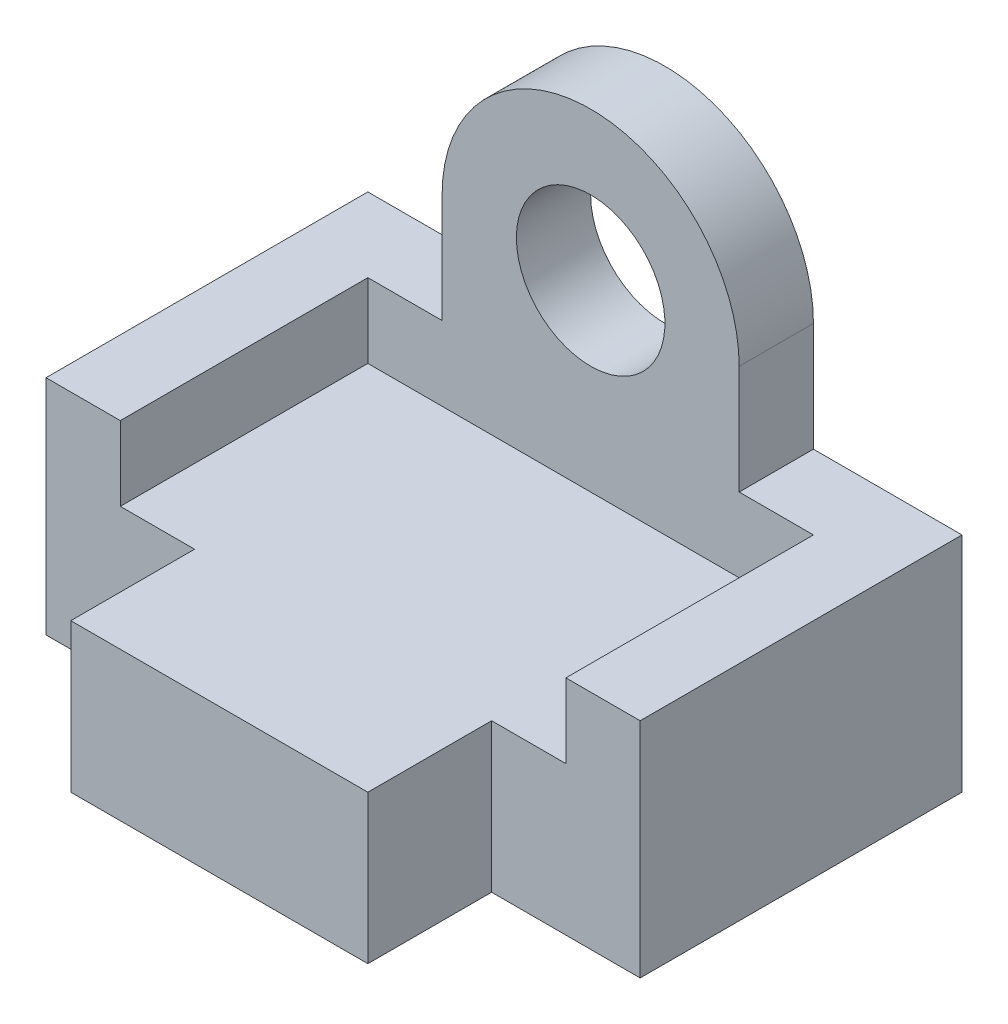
ISO-10303-21;
HEADER;
FILE_DESCRIPTION(('STEP AP214'),'2;1');
FILE_NAME('part.step','',(''),(''),'','','');
FILE_SCHEMA(('AUTOMOTIVE_DESIGN { 1 0 10303 214 1 1 1 1 }'));
ENDSEC;
DATA;
#1=APPLICATION_CONTEXT('core data for automotive mechanical design processes');
#2=APPLICATION_PROTOCOL_DEFINITION('international standard','automotive_design',2000,#1);
#3=PRODUCT_CONTEXT('',#1,'mechanical');
#4=PRODUCT('Part','Part','',(#3));
#5=PRODUCT_RELATED_PRODUCT_CATEGORY('part','',(#4));
#6=PRODUCT_DEFINITION_FORMATION('','',#4);
#7=PRODUCT_DEFINITION_CONTEXT('part definition',#1,'design');
#8=PRODUCT_DEFINITION('design','',#6,#7);
#9=PRODUCT_DEFINITION_SHAPE('','',#8);
#10=(LENGTH_UNIT() NAMED_UNIT(*) SI_UNIT(.MILLI.,.METRE.));
#11=(NAMED_UNIT(*) PLANE_ANGLE_UNIT() SI_UNIT($,.RADIAN.));
#12=(NAMED_UNIT(*) SI_UNIT($,.STERADIAN.) SOLID_ANGLE_UNIT());
#13=UNCERTAINTY_MEASURE_WITH_UNIT(LENGTH_MEASURE(1.E-05),#10,'distance_accuracy_value','');
#14=(GEOMETRIC_REPRESENTATION_CONTEXT(3) GLOBAL_UNCERTAINTY_ASSIGNED_CONTEXT((#13)) GLOBAL_UNIT_ASSIGNED_CONTEXT((#10,
#11,#12)) REPRESENTATION_CONTEXT('',''));
#15=CARTESIAN_POINT('',(0.,0.,0.));
#16=DIRECTION('',(0.,0.,1.));
#17=DIRECTION('',(1.,0.,0.));
#18=AXIS2_PLACEMENT_3D('',#15,#16,#17);
#19=CARTESIAN_POINT('',(-106.292846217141,45.,32.5));
#20=DIRECTION('',(0.,1.,0.));
#21=DIRECTION('',(0.,0.,1.));
#22=AXIS2_PLACEMENT_3D('',#19,#20,#21);
#23=PLANE('',#22);
#24=DIRECTION('',(1.,0.,0.));
#25=VECTOR('',#24,1.);
#26=CARTESIAN_POINT('',(-106.292846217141,45.,15.));
#27=LINE('',#26,#25);
#28=CARTESIAN_POINT('',(-45.,45.,15.));
#29=VERTEX_POINT('',#28);
#30=CARTESIAN_POINT('',(-30.,45.,15.));
#31=VERTEX_POINT('',#30);
#32=EDGE_CURVE('E162',#29,#31,#27,.T.);
#33=ORIENTED_EDGE('',*,*,#32,.T.);
#34=DIRECTION('',(0.,0.,-1.));
#35=VECTOR('',#34,1.);
#36=CARTESIAN_POINT('',(-30.,45.,15.));
#37=LINE('',#36,#35);
#38=CARTESIAN_POINT('',(-30.,45.,0.));
#39=VERTEX_POINT('',#38);
#40=EDGE_CURVE('E144',#31,#39,#37,.T.);
#41=ORIENTED_EDGE('',*,*,#40,.T.);
#42=DIRECTION('',(1.,0.,0.));
#43=VECTOR('',#42,1.);
#44=CARTESIAN_POINT('',(-106.292846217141,45.,0.));
#45=LINE('',#44,#43);
#46=CARTESIAN_POINT('',(-60.,45.,0.));
#47=VERTEX_POINT('',#46);
#48=EDGE_CURVE('E201',#47,#39,#45,.T.);
#49=ORIENTED_EDGE('',*,*,#48,.F.);
#50=DIRECTION('',(0.,0.,1.));
#51=VECTOR('',#50,1.);
#52=CARTESIAN_POINT('',(-60.,45.,32.5));
#53=LINE('',#52,#51);
#54=CARTESIAN_POINT('',(-60.,45.,65.));
#55=VERTEX_POINT('',#54);
#56=EDGE_CURVE('E196',#47,#55,#53,.T.);
#57=ORIENTED_EDGE('',*,*,#56,.T.);
#58=DIRECTION('',(1.,0.,0.));
#59=VECTOR('',#58,1.);
#60=CARTESIAN_POINT('',(-106.292846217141,45.,65.));
#61=LINE('',#60,#59);
#62=CARTESIAN_POINT('',(-45.,45.,65.));
#63=VERTEX_POINT('',#62);
#64=EDGE_CURVE('E203',#55,#63,#61,.T.);
#65=ORIENTED_EDGE('',*,*,#64,.T.);
#66=DIRECTION('',(0.,0.,1.));
#67=VECTOR('',#66,1.);
#68=CARTESIAN_POINT('',(-45.,45.,32.5));
#69=LINE('',#68,#67);
#70=EDGE_CURVE('E170',#29,#63,#69,.T.);
#71=ORIENTED_EDGE('',*,*,#70,.F.);
#72=EDGE_LOOP('',(#33,#41,#49,#57,#65,#71));
#73=FACE_BOUND('',#72,.T.);
#74=ADVANCED_FACE('F31',(#73),#23,.T.);
#75=CARTESIAN_POINT('',(-106.292846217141,30.,65.));
#76=DIRECTION('',(0.,0.,-1.));
#77=DIRECTION('',(-1.,0.,0.));
#78=AXIS2_PLACEMENT_3D('',#75,#76,#77);
#79=PLANE('',#78);
#80=DIRECTION('',(0.,-1.,0.));
#81=VECTOR('',#80,1.);
#82=CARTESIAN_POINT('',(-30.,30.,65.));
#83=LINE('',#82,#81);
#84=CARTESIAN_POINT('',(-30.,30.,65.));
#85=VERTEX_POINT('',#84);
#86=CARTESIAN_POINT('',(-30.,0.,65.));
#87=VERTEX_POINT('',#86);
#88=EDGE_CURVE('E56',#85,#87,#83,.T.);
#89=ORIENTED_EDGE('',*,*,#88,.F.);
#90=DIRECTION('',(1.,0.,0.));
#91=VECTOR('',#90,1.);
#92=CARTESIAN_POINT('',(-106.292846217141,30.,65.));
#93=LINE('',#92,#91);
#94=CARTESIAN_POINT('',(-45.,30.,65.));
#95=VERTEX_POINT('',#94);
#96=EDGE_CURVE('E253',#95,#85,#93,.T.);
#97=ORIENTED_EDGE('',*,*,#96,.F.);
#98=DIRECTION('',(0.,-1.,0.));
#99=VECTOR('',#98,1.);
#100=CARTESIAN_POINT('',(-45.,45.,65.));
#101=LINE('',#100,#99);
#102=EDGE_CURVE('E394',#63,#95,#101,.T.);
#103=ORIENTED_EDGE('',*,*,#102,.F.);
#104=ORIENTED_EDGE('',*,*,#64,.F.);
#105=DIRECTION('',(0.,-1.,0.));
#106=VECTOR('',#105,1.);
#107=CARTESIAN_POINT('',(-60.,45.,65.));
#108=LINE('',#107,#106);
#109=CARTESIAN_POINT('',(-60.,0.,65.));
#110=VERTEX_POINT('',#109);
#111=EDGE_CURVE('E396',#55,#110,#108,.T.);
#112=ORIENTED_EDGE('',*,*,#111,.T.);
#113=DIRECTION('',(1.,0.,0.));
#114=VECTOR('',#113,1.);
#115=CARTESIAN_POINT('',(-106.292846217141,0.,65.));
#116=LINE('',#115,#114);
#117=EDGE_CURVE('E257',#110,#87,#116,.T.);
#118=ORIENTED_EDGE('',*,*,#117,.T.);
#119=EDGE_LOOP('',(#89,#97,#103,#104,#112,#118));
#120=FACE_BOUND('',#119,.T.);
#121=ADVANCED_FACE('F33',(#120),#79,.F.);
#122=DIRECTION('',(0.,1.,0.));
#123=VECTOR('',#122,1.);
#124=CARTESIAN_POINT('',(30.,30.,65.));
#125=LINE('',#124,#123);
#126=CARTESIAN_POINT('',(30.,0.,65.));
#127=VERTEX_POINT('',#126);
#128=CARTESIAN_POINT('',(30.,30.,65.));
#129=VERTEX_POINT('',#128);
#130=EDGE_CURVE('E266',#127,#129,#125,.T.);
#131=ORIENTED_EDGE('',*,*,#130,.F.);
#132=CARTESIAN_POINT('',(60.,0.,65.));
#133=VERTEX_POINT('',#132);
#134=EDGE_CURVE('E235',#127,#133,#116,.T.);
#135=ORIENTED_EDGE('',*,*,#134,.T.);
#136=DIRECTION('',(0.,-1.,0.));
#137=VECTOR('',#136,1.);
#138=CARTESIAN_POINT('',(60.,45.,65.));
#139=LINE('',#138,#137);
#140=CARTESIAN_POINT('',(60.,45.,65.));
#141=VERTEX_POINT('',#140);
#142=EDGE_CURVE('E223',#141,#133,#139,.T.);
#143=ORIENTED_EDGE('',*,*,#142,.F.);
#144=DIRECTION('',(1.,0.,0.));
#145=VECTOR('',#144,1.);
#146=CARTESIAN_POINT('',(-106.292846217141,45.,65.));
#147=LINE('',#146,#145);
#148=CARTESIAN_POINT('',(45.,45.,65.));
#149=VERTEX_POINT('',#148);
#150=EDGE_CURVE('E174',#149,#141,#147,.T.);
#151=ORIENTED_EDGE('',*,*,#150,.F.);
#152=DIRECTION('',(0.,-1.,0.));
#153=VECTOR('',#152,1.);
#154=CARTESIAN_POINT('',(45.,45.,65.));
#155=LINE('',#154,#153);
#156=CARTESIAN_POINT('',(45.,30.,65.));
#157=VERTEX_POINT('',#156);
#158=EDGE_CURVE('E236',#149,#157,#155,.T.);
#159=ORIENTED_EDGE('',*,*,#158,.T.);
#160=EDGE_CURVE('E250',#129,#157,#93,.T.);
#161=ORIENTED_EDGE('',*,*,#160,.F.);
#162=EDGE_LOOP('',(#131,#135,#143,#151,#159,#161));
#163=FACE_BOUND('',#162,.T.);
#164=ADVANCED_FACE('F233',(#163),#79,.F.);
#165=CARTESIAN_POINT('',(-106.292846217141,30.,32.5));
#166=DIRECTION('',(0.,1.,0.));
#167=DIRECTION('',(0.,0.,1.));
#168=AXIS2_PLACEMENT_3D('',#165,#166,#167);
#169=PLANE('',#168);
#170=ORIENTED_EDGE('',*,*,#96,.T.);
#171=DIRECTION('',(0.,0.,-1.));
#172=VECTOR('',#171,1.);
#173=CARTESIAN_POINT('',(-30.,30.,90.));
#174=LINE('',#173,#172);
#175=CARTESIAN_POINT('',(-30.,30.,90.));
#176=VERTEX_POINT('',#175);
#177=EDGE_CURVE('E281',#176,#85,#174,.T.);
#178=ORIENTED_EDGE('',*,*,#177,.F.);
#179=DIRECTION('',(-1.,0.,0.));
#180=VECTOR('',#179,1.);
#181=CARTESIAN_POINT('',(-30.,30.,90.));
#182=LINE('',#181,#180);
#183=CARTESIAN_POINT('',(30.,30.,90.));
#184=VERTEX_POINT('',#183);
#185=EDGE_CURVE('E280',#184,#176,#182,.T.);
#186=ORIENTED_EDGE('',*,*,#185,.F.);
#187=DIRECTION('',(0.,0.,-1.));
#188=VECTOR('',#187,1.);
#189=CARTESIAN_POINT('',(30.,30.,90.));
#190=LINE('',#189,#188);
#191=EDGE_CURVE('E273',#184,#129,#190,.T.);
#192=ORIENTED_EDGE('',*,*,#191,.T.);
#193=ORIENTED_EDGE('',*,*,#160,.T.);
#194=DIRECTION('',(0.,0.,1.));
#195=VECTOR('',#194,1.);
#196=CARTESIAN_POINT('',(45.,30.,32.5));
#197=LINE('',#196,#195);
#198=CARTESIAN_POINT('',(45.,30.,15.));
#199=VERTEX_POINT('',#198);
#200=EDGE_CURVE('E246',#199,#157,#197,.T.);
#201=ORIENTED_EDGE('',*,*,#200,.F.);
#202=DIRECTION('',(1.,0.,0.));
#203=VECTOR('',#202,1.);
#204=CARTESIAN_POINT('',(-106.292846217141,30.,15.));
#205=LINE('',#204,#203);
#206=CARTESIAN_POINT('',(-45.,30.,15.));
#207=VERTEX_POINT('',#206);
#208=EDGE_CURVE('E40',#207,#199,#205,.T.);
#209=ORIENTED_EDGE('',*,*,#208,.F.);
#210=DIRECTION('',(0.,0.,1.));
#211=VECTOR('',#210,1.);
#212=CARTESIAN_POINT('',(-45.,30.,32.5));
#213=LINE('',#212,#211);
#214=EDGE_CURVE('E11',#207,#95,#213,.T.);
#215=ORIENTED_EDGE('',*,*,#214,.T.);
#216=EDGE_LOOP('',(#170,#178,#186,#192,#193,#201,#209,#215));
#217=FACE_BOUND('',#216,.T.);
#218=ADVANCED_FACE('F278',(#217),#169,.T.);
#219=CARTESIAN_POINT('',(-106.292846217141,0.,32.5));
#220=DIRECTION('',(0.,1.,0.));
#221=DIRECTION('',(0.,0.,1.));
#222=AXIS2_PLACEMENT_3D('',#219,#220,#221);
#223=PLANE('',#222);
#224=DIRECTION('',(0.,0.,1.));
#225=VECTOR('',#224,1.);
#226=CARTESIAN_POINT('',(60.,0.,32.5));
#227=LINE('',#226,#225);
#228=CARTESIAN_POINT('',(60.,0.,0.));
#229=VERTEX_POINT('',#228);
#230=EDGE_CURVE('E221',#229,#133,#227,.T.);
#231=ORIENTED_EDGE('',*,*,#230,.T.);
#232=ORIENTED_EDGE('',*,*,#134,.F.);
#233=DIRECTION('',(0.,0.,-1.));
#234=VECTOR('',#233,1.);
#235=CARTESIAN_POINT('',(30.,0.,90.));
#236=LINE('',#235,#234);
#237=CARTESIAN_POINT('',(30.,0.,90.));
#238=VERTEX_POINT('',#237);
#239=EDGE_CURVE('E276',#238,#127,#236,.T.);
#240=ORIENTED_EDGE('',*,*,#239,.F.);
#241=DIRECTION('',(1.,0.,0.));
#242=VECTOR('',#241,1.);
#243=CARTESIAN_POINT('',(-30.,0.,90.));
#244=LINE('',#243,#242);
#245=CARTESIAN_POINT('',(-30.,0.,90.));
#246=VERTEX_POINT('',#245);
#247=EDGE_CURVE('E301',#246,#238,#244,.T.);
#248=ORIENTED_EDGE('',*,*,#247,.F.);
#249=DIRECTION('',(0.,0.,-1.));
#250=VECTOR('',#249,1.);
#251=CARTESIAN_POINT('',(-30.,0.,90.));
#252=LINE('',#251,#250);
#253=EDGE_CURVE('E283',#246,#87,#252,.T.);
#254=ORIENTED_EDGE('',*,*,#253,.T.);
#255=ORIENTED_EDGE('',*,*,#117,.F.);
#256=DIRECTION('',(0.,0.,1.));
#257=VECTOR('',#256,1.);
#258=CARTESIAN_POINT('',(-60.,0.,32.5));
#259=LINE('',#258,#257);
#260=CARTESIAN_POINT('',(-60.,0.,0.));
#261=VERTEX_POINT('',#260);
#262=EDGE_CURVE('E176',#261,#110,#259,.T.);
#263=ORIENTED_EDGE('',*,*,#262,.F.);
#264=DIRECTION('',(1.,0.,0.));
#265=VECTOR('',#264,1.);
#266=CARTESIAN_POINT('',(-106.292846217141,0.,0.));
#267=LINE('',#266,#265);
#268=EDGE_CURVE('E385',#261,#229,#267,.T.);
#269=ORIENTED_EDGE('',*,*,#268,.T.);
#270=EDGE_LOOP('',(#231,#232,#240,#248,#254,#255,#263,#269));
#271=FACE_BOUND('',#270,.T.);
#272=ADVANCED_FACE('F378',(#271),#223,.F.);
#273=CARTESIAN_POINT('',(-106.292846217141,45.,15.));
#274=DIRECTION('',(0.,0.,-1.));
#275=DIRECTION('',(-1.,0.,0.));
#276=AXIS2_PLACEMENT_3D('',#273,#274,#275);
#277=PLANE('',#276);
#278=ORIENTED_EDGE('',*,*,#208,.T.);
#279=DIRECTION('',(0.,-1.,0.));
#280=VECTOR('',#279,1.);
#281=CARTESIAN_POINT('',(45.,45.,15.));
#282=LINE('',#281,#280);
#283=CARTESIAN_POINT('',(45.,45.,15.));
#284=VERTEX_POINT('',#283);
#285=EDGE_CURVE('E238',#284,#199,#282,.T.);
#286=ORIENTED_EDGE('',*,*,#285,.F.);
#287=CARTESIAN_POINT('',(30.,45.,15.));
#288=VERTEX_POINT('',#287);
#289=EDGE_CURVE('E172',#288,#284,#27,.T.);
#290=ORIENTED_EDGE('',*,*,#289,.F.);
#291=DIRECTION('',(0.,-1.,0.));
#292=VECTOR('',#291,1.);
#293=CARTESIAN_POINT('',(30.,45.,15.));
#294=LINE('',#293,#292);
#295=CARTESIAN_POINT('',(30.,67.,15.));
#296=VERTEX_POINT('',#295);
#297=EDGE_CURVE('E153',#296,#288,#294,.T.);
#298=ORIENTED_EDGE('',*,*,#297,.F.);
#299=CARTESIAN_POINT('',(0.,67.,15.));
#300=DIRECTION('',(0.,0.,-1.));
#301=DIRECTION('',(1.,0.,0.));
#302=AXIS2_PLACEMENT_3D('',#299,#300,#301);
#303=CIRCLE('',#302,30.);
#304=CARTESIAN_POINT('',(-30.,67.,15.));
#305=VERTEX_POINT('',#304);
#306=EDGE_CURVE('E166',#305,#296,#303,.T.);
#307=ORIENTED_EDGE('',*,*,#306,.F.);
#308=DIRECTION('',(0.,1.,0.));
#309=VECTOR('',#308,1.);
#310=CARTESIAN_POINT('',(-30.,67.,15.));
#311=LINE('',#310,#309);
#312=EDGE_CURVE('E147',#31,#305,#311,.T.);
#313=ORIENTED_EDGE('',*,*,#312,.F.);
#314=ORIENTED_EDGE('',*,*,#32,.F.);
#315=DIRECTION('',(0.,-1.,0.));
#316=VECTOR('',#315,1.);
#317=CARTESIAN_POINT('',(-45.,45.,15.));
#318=LINE('',#317,#316);
#319=EDGE_CURVE('E392',#29,#207,#318,.T.);
#320=ORIENTED_EDGE('',*,*,#319,.T.);
#321=EDGE_LOOP('',(#278,#286,#290,#298,#307,#313,#314,#320));
#322=FACE_BOUND('',#321,.T.);
#323=CARTESIAN_POINT('',(0.,67.,15.));
#324=DIRECTION('',(0.,0.,-1.));
#325=DIRECTION('',(-1.,0.,0.));
#326=AXIS2_PLACEMENT_3D('',#323,#324,#325);
#327=CIRCLE('',#326,15.);
#328=CARTESIAN_POINT('',(-15.,67.,15.));
#329=VERTEX_POINT('',#328);
#330=EDGE_CURVE('E324',#329,#329,#327,.T.);
#331=ORIENTED_EDGE('',*,*,#330,.T.);
#332=EDGE_LOOP('',(#331));
#333=FACE_BOUND('',#332,.T.);
#334=ADVANCED_FACE('F159',(#322,#333),#277,.F.);
#335=CARTESIAN_POINT('',(45.,45.,32.5));
#336=DIRECTION('',(1.,0.,0.));
#337=DIRECTION('',(0.,0.,-1.));
#338=AXIS2_PLACEMENT_3D('',#335,#336,#337);
#339=PLANE('',#338);
#340=ORIENTED_EDGE('',*,*,#200,.T.);
#341=ORIENTED_EDGE('',*,*,#158,.F.);
#342=DIRECTION('',(0.,0.,1.));
#343=VECTOR('',#342,1.);
#344=CARTESIAN_POINT('',(45.,45.,32.5));
#345=LINE('',#344,#343);
#346=EDGE_CURVE('E171',#284,#149,#345,.T.);
#347=ORIENTED_EDGE('',*,*,#346,.F.);
#348=ORIENTED_EDGE('',*,*,#285,.T.);
#349=EDGE_LOOP('',(#340,#341,#347,#348));
#350=FACE_BOUND('',#349,.T.);
#351=ADVANCED_FACE('F263',(#350),#339,.F.);
#352=CARTESIAN_POINT('',(60.,45.,32.5));
#353=DIRECTION('',(1.,0.,0.));
#354=DIRECTION('',(0.,0.,-1.));
#355=AXIS2_PLACEMENT_3D('',#352,#353,#354);
#356=PLANE('',#355);
#357=ORIENTED_EDGE('',*,*,#230,.F.);
#358=DIRECTION('',(0.,-1.,0.));
#359=VECTOR('',#358,1.);
#360=CARTESIAN_POINT('',(60.,45.,0.));
#361=LINE('',#360,#359);
#362=CARTESIAN_POINT('',(60.,45.,0.));
#363=VERTEX_POINT('',#362);
#364=EDGE_CURVE('E210',#363,#229,#361,.T.);
#365=ORIENTED_EDGE('',*,*,#364,.F.);
#366=DIRECTION('',(0.,0.,1.));
#367=VECTOR('',#366,1.);
#368=CARTESIAN_POINT('',(60.,45.,32.5));
#369=LINE('',#368,#367);
#370=EDGE_CURVE('E190',#363,#141,#369,.T.);
#371=ORIENTED_EDGE('',*,*,#370,.T.);
#372=ORIENTED_EDGE('',*,*,#142,.T.);
#373=EDGE_LOOP('',(#357,#365,#371,#372));
#374=FACE_BOUND('',#373,.T.);
#375=ADVANCED_FACE('F218',(#374),#356,.T.);
#376=CARTESIAN_POINT('',(-106.292846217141,45.,0.));
#377=DIRECTION('',(0.,0.,-1.));
#378=DIRECTION('',(-1.,0.,0.));
#379=AXIS2_PLACEMENT_3D('',#376,#377,#378);
#380=PLANE('',#379);
#381=ORIENTED_EDGE('',*,*,#268,.F.);
#382=DIRECTION('',(0.,-1.,0.));
#383=VECTOR('',#382,1.);
#384=CARTESIAN_POINT('',(-60.,45.,0.));
#385=LINE('',#384,#383);
#386=EDGE_CURVE('E224',#47,#261,#385,.T.);
#387=ORIENTED_EDGE('',*,*,#386,.F.);
#388=ORIENTED_EDGE('',*,*,#48,.T.);
#389=DIRECTION('',(0.,1.,0.));
#390=VECTOR('',#389,1.);
#391=CARTESIAN_POINT('',(-30.,67.,0.));
#392=LINE('',#391,#390);
#393=CARTESIAN_POINT('',(-30.,67.,0.));
#394=VERTEX_POINT('',#393);
#395=EDGE_CURVE('E48',#39,#394,#392,.T.);
#396=ORIENTED_EDGE('',*,*,#395,.T.);
#397=CARTESIAN_POINT('',(0.,67.,0.));
#398=DIRECTION('',(0.,0.,-1.));
#399=DIRECTION('',(1.,0.,0.));
#400=AXIS2_PLACEMENT_3D('',#397,#398,#399);
#401=CIRCLE('',#400,30.);
#402=CARTESIAN_POINT('',(30.,67.,0.));
#403=VERTEX_POINT('',#402);
#404=EDGE_CURVE('E319',#394,#403,#401,.T.);
#405=ORIENTED_EDGE('',*,*,#404,.T.);
#406=DIRECTION('',(0.,-1.,0.));
#407=VECTOR('',#406,1.);
#408=CARTESIAN_POINT('',(30.,45.,0.));
#409=LINE('',#408,#407);
#410=CARTESIAN_POINT('',(30.,45.,0.));
#411=VERTEX_POINT('',#410);
#412=EDGE_CURVE('E167',#403,#411,#409,.T.);
#413=ORIENTED_EDGE('',*,*,#412,.T.);
#414=EDGE_CURVE('E193',#411,#363,#45,.T.);
#415=ORIENTED_EDGE('',*,*,#414,.T.);
#416=ORIENTED_EDGE('',*,*,#364,.T.);
#417=EDGE_LOOP('',(#381,#387,#388,#396,#405,#413,#415,#416));
#418=FACE_BOUND('',#417,.T.);
#419=CARTESIAN_POINT('',(0.,67.,0.));
#420=DIRECTION('',(0.,0.,-1.));
#421=DIRECTION('',(-1.,0.,0.));
#422=AXIS2_PLACEMENT_3D('',#419,#420,#421);
#423=CIRCLE('',#422,15.);
#424=CARTESIAN_POINT('',(-15.,67.,0.));
#425=VERTEX_POINT('',#424);
#426=EDGE_CURVE('E326',#425,#425,#423,.T.);
#427=ORIENTED_EDGE('',*,*,#426,.F.);
#428=EDGE_LOOP('',(#427));
#429=FACE_BOUND('',#428,.T.);
#430=ADVANCED_FACE('F208',(#418,#429),#380,.T.);
#431=CARTESIAN_POINT('',(-60.,45.,32.5));
#432=DIRECTION('',(1.,0.,0.));
#433=DIRECTION('',(0.,0.,-1.));
#434=AXIS2_PLACEMENT_3D('',#431,#432,#433);
#435=PLANE('',#434);
#436=ORIENTED_EDGE('',*,*,#262,.T.);
#437=ORIENTED_EDGE('',*,*,#111,.F.);
#438=ORIENTED_EDGE('',*,*,#56,.F.);
#439=ORIENTED_EDGE('',*,*,#386,.T.);
#440=EDGE_LOOP('',(#436,#437,#438,#439));
#441=FACE_BOUND('',#440,.T.);
#442=ADVANCED_FACE('F361',(#441),#435,.F.);
#443=CARTESIAN_POINT('',(-45.,45.,32.5));
#444=DIRECTION('',(1.,0.,0.));
#445=DIRECTION('',(0.,0.,-1.));
#446=AXIS2_PLACEMENT_3D('',#443,#444,#445);
#447=PLANE('',#446);
#448=ORIENTED_EDGE('',*,*,#102,.T.);
#449=ORIENTED_EDGE('',*,*,#214,.F.);
#450=ORIENTED_EDGE('',*,*,#319,.F.);
#451=ORIENTED_EDGE('',*,*,#70,.T.);
#452=EDGE_LOOP('',(#448,#449,#450,#451));
#453=FACE_BOUND('',#452,.T.);
#454=ADVANCED_FACE('F355',(#453),#447,.T.);
#455=DIRECTION('',(0.,0.,-1.));
#456=VECTOR('',#455,1.);
#457=CARTESIAN_POINT('',(30.,45.,15.));
#458=LINE('',#457,#456);
#459=EDGE_CURVE('E295',#288,#411,#458,.T.);
#460=ORIENTED_EDGE('',*,*,#459,.F.);
#461=ORIENTED_EDGE('',*,*,#289,.T.);
#462=ORIENTED_EDGE('',*,*,#346,.T.);
#463=ORIENTED_EDGE('',*,*,#150,.T.);
#464=ORIENTED_EDGE('',*,*,#370,.F.);
#465=ORIENTED_EDGE('',*,*,#414,.F.);
#466=EDGE_LOOP('',(#460,#461,#462,#463,#464,#465));
#467=FACE_BOUND('',#466,.T.);
#468=ADVANCED_FACE('F226',(#467),#23,.T.);
#469=CARTESIAN_POINT('',(-30.,30.,90.));
#470=DIRECTION('',(1.,0.,0.));
#471=DIRECTION('',(0.,1.,0.));
#472=AXIS2_PLACEMENT_3D('',#469,#470,#471);
#473=PLANE('',#472);
#474=ORIENTED_EDGE('',*,*,#88,.T.);
#475=ORIENTED_EDGE('',*,*,#253,.F.);
#476=DIRECTION('',(0.,-1.,0.));
#477=VECTOR('',#476,1.);
#478=CARTESIAN_POINT('',(-30.,30.,90.));
#479=LINE('',#478,#477);
#480=EDGE_CURVE('E277',#176,#246,#479,.T.);
#481=ORIENTED_EDGE('',*,*,#480,.F.);
#482=ORIENTED_EDGE('',*,*,#177,.T.);
#483=EDGE_LOOP('',(#474,#475,#481,#482));
#484=FACE_BOUND('',#483,.T.);
#485=ADVANCED_FACE('F354',(#484),#473,.F.);
#486=CARTESIAN_POINT('',(30.,30.,90.));
#487=DIRECTION('',(-1.,0.,0.));
#488=DIRECTION('',(0.,-1.,0.));
#489=AXIS2_PLACEMENT_3D('',#486,#487,#488);
#490=PLANE('',#489);
#491=ORIENTED_EDGE('',*,*,#130,.T.);
#492=ORIENTED_EDGE('',*,*,#191,.F.);
#493=DIRECTION('',(0.,1.,0.));
#494=VECTOR('',#493,1.);
#495=CARTESIAN_POINT('',(30.,30.,90.));
#496=LINE('',#495,#494);
#497=EDGE_CURVE('E299',#238,#184,#496,.T.);
#498=ORIENTED_EDGE('',*,*,#497,.F.);
#499=ORIENTED_EDGE('',*,*,#239,.T.);
#500=EDGE_LOOP('',(#491,#492,#498,#499));
#501=FACE_BOUND('',#500,.T.);
#502=ADVANCED_FACE('F271',(#501),#490,.F.);
#503=CARTESIAN_POINT('',(-30.,30.,90.));
#504=DIRECTION('',(0.,0.,1.));
#505=DIRECTION('',(1.,0.,0.));
#506=AXIS2_PLACEMENT_3D('',#503,#504,#505);
#507=PLANE('',#506);
#508=ORIENTED_EDGE('',*,*,#480,.T.);
#509=ORIENTED_EDGE('',*,*,#247,.T.);
#510=ORIENTED_EDGE('',*,*,#497,.T.);
#511=ORIENTED_EDGE('',*,*,#185,.T.);
#512=EDGE_LOOP('',(#508,#509,#510,#511));
#513=FACE_BOUND('',#512,.T.);
#514=ADVANCED_FACE('F336',(#513),#507,.T.);
#515=CARTESIAN_POINT('',(30.,45.,15.));
#516=DIRECTION('',(1.,0.,0.));
#517=DIRECTION('',(0.,1.,0.));
#518=AXIS2_PLACEMENT_3D('',#515,#516,#517);
#519=PLANE('',#518);
#520=ORIENTED_EDGE('',*,*,#412,.F.);
#521=DIRECTION('',(0.,0.,-1.));
#522=VECTOR('',#521,1.);
#523=CARTESIAN_POINT('',(30.,67.,15.));
#524=LINE('',#523,#522);
#525=EDGE_CURVE('E315',#296,#403,#524,.T.);
#526=ORIENTED_EDGE('',*,*,#525,.F.);
#527=ORIENTED_EDGE('',*,*,#297,.T.);
#528=ORIENTED_EDGE('',*,*,#459,.T.);
#529=EDGE_LOOP('',(#520,#526,#527,#528));
#530=FACE_BOUND('',#529,.T.);
#531=ADVANCED_FACE('F332',(#530),#519,.T.);
#532=CARTESIAN_POINT('',(0.,67.,15.));
#533=DIRECTION('',(0.,0.,-1.));
#534=DIRECTION('',(-1.,0.,0.));
#535=AXIS2_PLACEMENT_3D('',#532,#533,#534);
#536=CYLINDRICAL_SURFACE('',#535,30.);
#537=ORIENTED_EDGE('',*,*,#404,.F.);
#538=DIRECTION('',(0.,0.,-1.));
#539=VECTOR('',#538,1.);
#540=CARTESIAN_POINT('',(-30.,67.,15.));
#541=LINE('',#540,#539);
#542=EDGE_CURVE('E152',#305,#394,#541,.T.);
#543=ORIENTED_EDGE('',*,*,#542,.F.);
#544=ORIENTED_EDGE('',*,*,#306,.T.);
#545=ORIENTED_EDGE('',*,*,#525,.T.);
#546=EDGE_LOOP('',(#537,#543,#544,#545));
#547=FACE_BOUND('',#546,.T.);
#548=ADVANCED_FACE('F323',(#547),#536,.T.);
#549=CARTESIAN_POINT('',(-30.,67.,15.));
#550=DIRECTION('',(-1.,0.,0.));
#551=DIRECTION('',(0.,-1.,0.));
#552=AXIS2_PLACEMENT_3D('',#549,#550,#551);
#553=PLANE('',#552);
#554=ORIENTED_EDGE('',*,*,#395,.F.);
#555=ORIENTED_EDGE('',*,*,#40,.F.);
#556=ORIENTED_EDGE('',*,*,#312,.T.);
#557=ORIENTED_EDGE('',*,*,#542,.T.);
#558=EDGE_LOOP('',(#554,#555,#556,#557));
#559=FACE_BOUND('',#558,.T.);
#560=ADVANCED_FACE('F146',(#559),#553,.T.);
#561=CARTESIAN_POINT('',(0.,67.,15.));
#562=DIRECTION('',(0.,0.,-1.));
#563=DIRECTION('',(-1.,0.,0.));
#564=AXIS2_PLACEMENT_3D('',#561,#562,#563);
#565=CYLINDRICAL_SURFACE('',#564,15.);
#566=ORIENTED_EDGE('',*,*,#330,.F.);
#567=EDGE_LOOP('',(#566));
#568=FACE_BOUND('',#567,.T.);
#569=ORIENTED_EDGE('',*,*,#426,.T.);
#570=EDGE_LOOP('',(#569));
#571=FACE_BOUND('',#570,.T.);
#572=ADVANCED_FACE('F516',(#568,#571),#565,.F.);
#573=CLOSED_SHELL('',(#74,#121,#164,#218,#272,#334,#351,#375,#430,#442,#454,#468,#485,#502,#514,
#531,#548,#560,#572));
#574=MANIFOLD_SOLID_BREP('B2',#573);
#575=ADVANCED_BREP_SHAPE_REPRESENTATION('',(#18,#574),#14);
#576=SHAPE_DEFINITION_REPRESENTATION(#9,#575);
ENDSEC;
END-ISO-10303-21;
